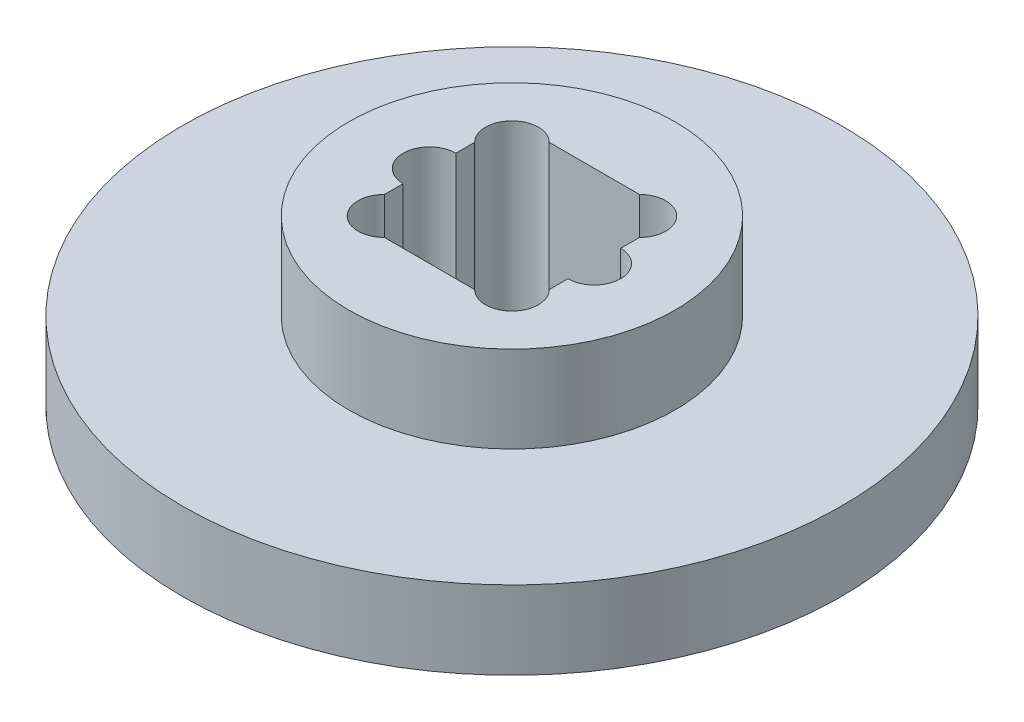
from build123d import *

# Parameters (mm, degrees)
ESQUISSE1_R             = 20
BOSS_EXTRU_1_DEPTH      = 4.75
ESQUISSE2_R             = 9.9
BOSS_EXTRU_2_DEPTH      = 5.25
ENL_V_MAT_EXTRU_1_DEPTH = 31
ESQUISSE4_R             = 1.6
ENL_V_MAT_EXTRU_2_DEPTH = 10


with BuildPart() as part:
    # Esquisse1 → Boss.-Extru.1 (new body)
    with BuildSketch(Plane(origin=(0, 0, 0), x_dir=(1, 0, 0), z_dir=(0, 1, 0))):
        with Locations(Location((0, 0, 0), (0, 0, 270))):
            Circle(ESQUISSE1_R)
    extrude(amount=BOSS_EXTRU_1_DEPTH)

    # Esquisse2 → Boss.-Extru.2 (add)
    with BuildSketch(Plane(origin=(0, 4.75, 0), x_dir=(1, 0, 0), z_dir=(0, 1, 0))):
        with Locations(Location((0, 0, 0), (0, 0, 90))):
            Circle(ESQUISSE2_R)
    extrude(amount=BOSS_EXTRU_2_DEPTH)

    # Esquisse3 → Enl_v. mat.-Extru.1 (cut, through all)
    with BuildSketch(Plane(origin=(0, 10, 0), x_dir=(1, 0, 0), z_dir=(0, 1, 0))):
        with BuildLine():
            Line((-2.7372583, 5), (2.7372583, 5))
            ThreePointArc((2.7372583, 5), (5, 5), (5, 2.7372583))
            Line((5, 2.7372583), (5, -2.7372583))
            ThreePointArc((5, -2.7372583), (5, -5), (2.7372583, -5))
            Line((2.7372583, -5), (-2.7372583, -5))
            ThreePointArc((-2.7372583, -5), (-5, -5), (-5, -2.7372583))
            Line((-5, -2.7372583), (-5, 2.7372583))
            ThreePointArc((-5, 2.7372583), (-5, 5), (-2.7372583, 5))
        make_face()
    extrude(amount=-ENL_V_MAT_EXTRU_1_DEPTH, mode=Mode.SUBTRACT)

    # Esquisse4 → Enl_v. mat.-Extru.2 (cut)
    with BuildSketch(Plane(origin=(0, 0, 0), x_dir=(-1, 0, 0), z_dir=(0, -1, 0))):
        with Locations((5, 0)):
            Circle(ESQUISSE4_R)
        with Locations((-5, 0)):
            Circle(ESQUISSE4_R)
    extrude(amount=-ENL_V_MAT_EXTRU_2_DEPTH, mode=Mode.SUBTRACT)


solid = part.part
